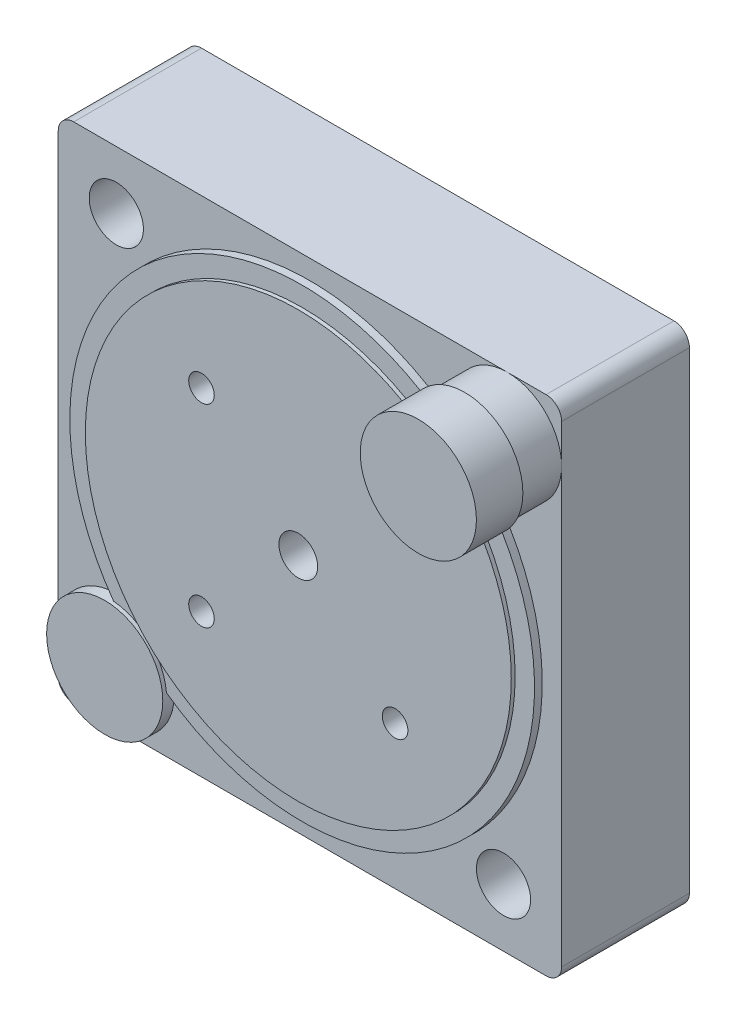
from build123d import *

# Parameters (mm, degrees)
SKETCH_1_W             = 65
SKETCH_1_H             = 65
EXTRUDE_1_DEPTH        = 16.5
SKETCH_2_R             = 30
EXTRUDE_2_DEPTH        = 1.5
SKETCH_4_OUTSIDE_W     = 85.734
SKETCH_4_OUTSIDE_H     = 85.734
SKETCH_4_OUTSIDE_R     = 27.5
CUT_EXTRUDE_1_DEPTH    = 0.5
SKETCH_3_R             = 7.5
EXTRUDE_3_DEPTH        = 1.5
SKETCH_5_R             = 7
EXTRUDE_4_DEPTH        = 11.5
SKETCH_6_R             = 7.5
EXTRUDE_5_DEPTH        = 6
HOLE_WIZARD_7_0_7_1_D  = 7
HOLE_WIZARD_M6_1_D     = 5
HOLE_WIZARD_M4_1_D     = 3.3
FILLET_1_R             = 2
HOLE_WIZARD_M6_2_D     = 5
HOLE_WIZARD_M6_2_DEPTH = 15
HOLE_WIZARD_M6_2_TIP   = 1.502151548
SKETCH_15_W            = 0.73828125
SKETCH_15_H            = 0.873597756
SKETCH_15_W_2          = 0.776141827
SKETCH_15_H_2          = 1.053084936
CUT_EXTRUDE_2_DEPTH    = 3


with BuildPart() as part:
    # Sketch 1 → Extrude 1 (new body)
    with BuildSketch(Plane.XY):
        Rectangle(SKETCH_1_W, SKETCH_1_H)
    extrude(amount=EXTRUDE_1_DEPTH)

    # Sketch 2 → Extrude 2 (add)
    with BuildSketch(Plane.XY.offset(16.5)):
        Circle(SKETCH_2_R)
    extrude(amount=EXTRUDE_2_DEPTH)

    # Sketch 4 outside → Cut-Extrude 1 (cut)
    with BuildSketch(Plane.XY.offset(18)):
        Rectangle(SKETCH_4_OUTSIDE_W, SKETCH_4_OUTSIDE_H)
        Circle(SKETCH_4_OUTSIDE_R, mode=Mode.SUBTRACT)
    extrude(amount=-CUT_EXTRUDE_1_DEPTH, mode=Mode.SUBTRACT)

    # Sketch 3 → Extrude 3 (add)
    with BuildSketch(Plane.XY.offset(16.5)):
        with Locations(Location((-25, -25, 0), (0, 0, 180))):
            Circle(SKETCH_3_R)
    extrude(amount=EXTRUDE_3_DEPTH)

    # Sketch 5 → Extrude 4 (add)
    with BuildSketch(Plane.XY.offset(16.5)):
        with Locations((25.5, 25.5)):
            Circle(SKETCH_5_R)
    extrude(amount=EXTRUDE_4_DEPTH)

    # Sketch 6 → Extrude 5 (add)
    with BuildSketch(Plane.XY.offset(28)):
        with Locations((25.5, 25.5)):
            Circle(SKETCH_6_R)
    extrude(amount=-EXTRUDE_5_DEPTH)

    # Hole Wizard 7.0 _7_ _1 (through all)
    with Locations(Plane.XY.offset(16.5)):
        with Locations((-25, 25), (25, -25)):
            Hole(HOLE_WIZARD_7_0_7_1_D / 2)

    # Hole Wizard M6 _1 (through all)
    with Locations(Plane.XY.offset(18)):
        with Locations((0, 0)):
            Hole(HOLE_WIZARD_M6_1_D / 2)

    # Hole Wizard M4 _1 (through all)
    with Locations(Plane.XY.offset(18)):
        with Locations((-12.5, 12.5), (12.5, 12.5), (-12.5, -12.5), (12.5, -12.5)):
            Hole(HOLE_WIZARD_M4_1_D / 2)

    # Fillet 1
    fillet_1_edges = [part.edges().sort_by_distance(p)[0] for p in [
        (32.5, -32.5, 8.25),
        (-32.5, -32.5, 8.25),
        (-32.5, 32.5, 8.25),
        (32.5, 32.5, 8.25),
    ]]
    fillet(fillet_1_edges, radius=FILLET_1_R)

    # Hole Wizard M6 _2
    with Locations(Plane.ZY.offset(32.5)):
        with Locations((9, 0)):
            Hole(HOLE_WIZARD_M6_2_D / 2, depth=HOLE_WIZARD_M6_2_DEPTH)
            with Locations((0, 0, -(HOLE_WIZARD_M6_2_DEPTH + HOLE_WIZARD_M6_2_TIP / 2))):  # 118° drill point
                Cone(0, HOLE_WIZARD_M6_2_D / 2, HOLE_WIZARD_M6_2_TIP, mode=Mode.SUBTRACT)

    # Sketch 15 → Cut-Extrude 2 (cut)
    # profile 1 of 11: a face of its own
    with BuildSketch(Plane.XZ.offset(32.5)):
        with BuildLine():
            Line((-5.189964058, 4.936644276), (-4.906009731, 4.747341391))
            add(Edge.make_bspline(
                [(-4.906009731, 4.747341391), (-4.845937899, 4.756158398), (-4.728766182, 4.773356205), (-4.557537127, 4.799576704), (-4.395631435, 4.827826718), (-4.242743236, 4.856430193), (-4.098766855, 4.885920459), (-3.963627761, 4.915919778), (-3.837570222, 4.946551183), (-3.72071617, 4.978247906), (-3.612866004, 5.010274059), (-3.513889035, 5.043079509), (-3.423882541, 5.076835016), (-3.34266128, 5.110628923), (-3.270718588, 5.14604351), (-3.207322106, 5.181097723), (-3.153628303, 5.218430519), (-3.122398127, 5.245132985), (-3.107632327, 5.257758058)],
                knots=[0, 0, 0, 0, 1.544068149, 3.01174623, 4.405109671, 5.723493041, 6.967204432, 8.142411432, 9.243727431, 10.265945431, 11.221193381, 12.104547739, 12.91703865, 13.665462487, 14.340610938, 14.955432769, 15.506122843, 16, 16, 16, 16], degree=3))
            Line((-3.107632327, 5.257758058), (-2.842608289, 4.87985341))
            add(Edge.make_bspline(
                [(-2.842608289, 4.87985341), (-2.867150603, 4.879765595), (-2.918354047, 4.879582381), (-2.998277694, 4.876320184), (-3.084084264, 4.872422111), (-3.175935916, 4.865892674), (-3.273373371, 4.857416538), (-3.376895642, 4.84746902), (-3.486325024, 4.836477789), (-3.561270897, 4.827619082), (-3.599819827, 4.823062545)],
                knots=[0, 0, 0, 0, 0.775214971, 1.617356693, 2.526504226, 3.488547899, 4.525910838, 5.616073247, 6.773810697, 8, 8, 8, 8], degree=3))
            add(Edge.make_bspline(
                [(-3.599819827, 4.823062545), (-3.64118565, 4.816750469), (-3.727641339, 4.803558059), (-3.862624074, 4.783002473), (-4.008927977, 4.762613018), (-4.166573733, 4.742772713), (-4.335480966, 4.720780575), (-4.515631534, 4.698241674), (-4.707094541, 4.676029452), (-4.838465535, 4.661078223), (-4.906009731, 4.653391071)],
                knots=[0, 0, 0, 0, 0.762389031, 1.593413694, 2.487650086, 3.453631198, 4.488270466, 5.591033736, 6.761433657, 8, 8, 8, 8], degree=3))
            add(Edge.make_bspline(
                [(-4.906009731, 4.653391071), (-4.906193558, 4.585148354), (-4.906556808, 4.450297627), (-4.907957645, 4.250943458), (-4.910127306, 4.056966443), (-4.912640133, 3.868819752), (-4.917099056, 3.686067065), (-4.921926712, 3.509147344), (-4.927473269, 3.337591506), (-4.934107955, 3.171363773), (-4.943937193, 3.009672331), (-4.960848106, 2.852474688), (-4.984011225, 2.699255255), (-5.013291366, 2.549666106), (-5.04969282, 2.403602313), (-5.093475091, 2.261577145), (-5.142140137, 2.122945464), (-5.198848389, 1.98825135), (-5.262733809, 1.855399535), (-5.336953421, 1.724098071), (-5.420116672, 1.5929975), (-5.514122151, 1.463091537), (-5.617073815, 1.333286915), (-5.730552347, 1.20435745), (-5.852711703, 1.07505357), (-5.940449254, 0.992180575), (-5.985036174, 0.95006575)],
                knots=[0, 0, 0, 0, 1.224615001, 2.419895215, 3.577469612, 4.705743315, 5.796437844, 6.857891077, 7.881743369, 8.876573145, 9.843210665, 10.788012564, 11.712690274, 12.623183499, 13.522353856, 14.41253017, 15.289328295, 16.157781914, 17.033737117, 17.933161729, 18.862743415, 19.81830003, 20.809276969, 21.834648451, 22.899600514, 24, 24, 24, 24], degree=3))
            Line((-5.985036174, 0.95006575), (-6.041827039, 1.006856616))
            add(Edge.make_bspline(
                [(-6.041827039, 1.006856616), (-6.007827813, 1.046537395), (-5.940335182, 1.125308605), (-5.845566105, 1.248039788), (-5.756089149, 1.373118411), (-5.674710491, 1.502553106), (-5.597605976, 1.633390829), (-5.528300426, 1.768039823), (-5.464476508, 1.905252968), (-5.406137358, 2.046747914), (-5.354575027, 2.195281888), (-5.309520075, 2.353447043), (-5.272434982, 2.522906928), (-5.23958059, 2.702830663), (-5.216049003, 2.894172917), (-5.196700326, 3.095893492), (-5.18513532, 3.308745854), (-5.180363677, 3.528299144), (-5.178514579, 3.746836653), (-5.178210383, 3.956009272), (-5.177064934, 4.152087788), (-5.17764307, 4.334622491), (-5.180248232, 4.504050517), (-5.181768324, 4.659952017), (-5.185453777, 4.802746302), (-5.188507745, 4.893410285), (-5.189964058, 4.936644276)],
                knots=[0, 0, 0, 0, 0.908799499, 1.804078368, 2.696297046, 3.582708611, 4.462617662, 5.337176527, 6.215647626, 7.094372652, 7.998175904, 8.949130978, 9.953139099, 11.014501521, 12.129355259, 13.305269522, 14.538965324, 15.836175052, 17.124904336, 18.340408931, 19.474609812, 20.535637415, 21.515428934, 22.422052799, 23.247540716, 24, 24, 24, 24], degree=3))
        make_face()
    # profile 2 of 11: a face of its own
    with BuildSketch(Plane.XZ.offset(32.5)):
        with BuildLine():
            add(Edge.make_bspline(
                [(-4.640985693, 1.346900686), (-4.633415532, 1.35554184), (-4.617688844, 1.373493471), (-4.599518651, 1.406716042), (-4.585330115, 1.445595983), (-4.572767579, 1.489982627), (-4.566877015, 1.540754), (-4.56237651, 1.596870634), (-4.561853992, 1.658942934), (-4.56409112, 1.702144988), (-4.565264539, 1.724805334)],
                knots=[0, 0, 0, 0, 0.695601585, 1.445082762, 2.280142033, 3.205704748, 4.236765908, 5.374684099, 6.622969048, 8, 8, 8, 8], degree=3))
            Line((-4.565264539, 1.724805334), (-4.565264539, 3.556135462))
            add(Edge.make_bspline(
                [(-4.565264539, 3.556135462), (-4.565556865, 3.616668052), (-4.566120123, 3.733303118), (-4.569732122, 3.90088261), (-4.574768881, 4.054495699), (-4.581148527, 4.151867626), (-4.584194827, 4.198363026)],
                knots=[0, 0, 0, 0, 1.130337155, 2.177949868, 3.129965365, 4, 4, 4, 4], degree=3))
            Line((-4.584194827, 4.198363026), (-4.319170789, 4.028691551))
            add(Edge.make_bspline(
                [(-4.319170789, 4.028691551), (-4.248933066, 4.041399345), (-4.113303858, 4.065938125), (-3.918666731, 4.111473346), (-3.739009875, 4.159497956), (-3.574971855, 4.214473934), (-3.425585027, 4.273982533), (-3.291875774, 4.341467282), (-3.172539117, 4.414976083), (-3.10329801, 4.472630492), (-3.069771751, 4.500546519)],
                knots=[0, 0, 0, 0, 1.267382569, 2.447318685, 3.548814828, 4.568596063, 5.518112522, 6.401622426, 7.226072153, 8, 8, 8, 8], degree=3))
            Line((-3.069771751, 4.500546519), (-2.804747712, 4.179432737))
            add(Edge.make_bspline(
                [(-2.804747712, 4.179432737), (-2.847070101, 4.175676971), (-2.933947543, 4.167967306), (-3.067753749, 4.151812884), (-3.208379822, 4.129755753), (-3.304445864, 4.11254196), (-3.353726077, 4.103711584)],
                knots=[0, 0, 0, 0, 0.919581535, 1.887674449, 2.916413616, 4, 4, 4, 4], degree=3))
            add(Edge.make_bspline(
                [(-3.353726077, 4.103711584), (-3.402538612, 4.091888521), (-3.49697923, 4.069013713), (-3.634130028, 4.038158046), (-3.761924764, 4.011797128), (-3.844238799, 3.99763367), (-3.883774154, 3.990830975)],
                knots=[0, 0, 0, 0, 1.111816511, 2.151099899, 3.111974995, 4, 4, 4, 4], degree=3))
            add(Edge.make_bspline(
                [(-3.883774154, 3.990830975), (-3.876255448, 3.932143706), (-3.861865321, 3.81982155), (-3.838245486, 3.659627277), (-3.817135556, 3.515020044), (-3.795291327, 3.386746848), (-3.774279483, 3.274313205), (-3.754460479, 3.177591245), (-3.734325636, 3.096946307), (-3.719865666, 3.048946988), (-3.713401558, 3.027489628)],
                knots=[0, 0, 0, 0, 1.450010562, 2.775189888, 3.968369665, 5.031461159, 5.963854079, 6.771533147, 7.450832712, 8, 8, 8, 8], degree=3))
            add(Edge.make_bspline(
                [(-3.713401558, 3.027489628), (-3.668993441, 3.055643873), (-3.581922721, 3.110845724), (-3.45816386, 3.197915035), (-3.342349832, 3.285485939), (-3.236429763, 3.375243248), (-3.137928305, 3.46483534), (-3.049946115, 3.556863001), (-2.969807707, 3.649396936), (-2.922594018, 3.713799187), (-2.899399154, 3.745438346)],
                knots=[0, 0, 0, 0, 1.154897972, 2.264401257, 3.323042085, 4.343228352, 5.313317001, 6.24645786, 7.138530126, 8, 8, 8, 8], degree=3))
            Line((-2.899399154, 3.745438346), (-2.615444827, 3.405394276))
            add(Edge.make_bspline(
                [(-2.615444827, 3.405394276), (-2.630430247, 3.40475802), (-2.661743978, 3.403428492), (-2.710780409, 3.395123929), (-2.763797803, 3.381891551), (-2.820853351, 3.362217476), (-2.882437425, 3.33882871), (-2.94757594, 3.308750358), (-3.017266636, 3.274616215), (-3.064276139, 3.248560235), (-3.088702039, 3.23502168)],
                knots=[0, 0, 0, 0, 0.708525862, 1.480544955, 2.34612496, 3.289518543, 4.331893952, 5.459395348, 6.679914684, 8, 8, 8, 8], degree=3))
            add(Edge.make_bspline(
                [(-3.088702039, 3.23502168), (-3.141454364, 3.20731816), (-3.245008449, 3.152935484), (-3.398723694, 3.074943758), (-3.548030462, 3.002172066), (-3.646285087, 2.955652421), (-3.69447127, 2.932838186)],
                knots=[0, 0, 0, 0, 1.056100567, 2.073150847, 3.055031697, 4, 4, 4, 4], degree=3))
            add(Edge.make_bspline(
                [(-3.69447127, 2.932838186), (-3.67267685, 2.872154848), (-3.630432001, 2.754530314), (-3.562458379, 2.586343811), (-3.493296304, 2.431830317), (-3.422598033, 2.291467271), (-3.350970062, 2.164903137), (-3.279285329, 2.051289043), (-3.205034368, 1.952230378), (-3.128903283, 1.866335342), (-3.051705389, 1.790579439), (-2.972724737, 1.722654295), (-2.892897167, 1.659809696), (-2.810715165, 1.603536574), (-2.726345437, 1.553973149), (-2.641042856, 1.509392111), (-2.553482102, 1.471991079), (-2.493820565, 1.45169556), (-2.46400252, 1.441552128)],
                knots=[0, 0, 0, 0, 1.538195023, 2.981534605, 4.326673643, 5.575948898, 6.72951937, 7.795199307, 8.778759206, 9.679373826, 10.531020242, 11.35715119, 12.163553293, 12.953833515, 13.73126344, 14.496846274, 15.248743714, 16, 16, 16, 16], degree=3))
            Line((-2.46400252, 1.441552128), (-2.46400252, 1.365830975))
            add(Edge.make_bspline(
                [(-2.46400252, 1.365830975), (-2.492594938, 1.362595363), (-2.547073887, 1.356430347), (-2.623764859, 1.339762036), (-2.692055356, 1.320785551), (-2.751471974, 1.297101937), (-2.802128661, 1.268996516), (-2.843759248, 1.236697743), (-2.877896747, 1.200610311), (-2.892300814, 1.172266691), (-2.899399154, 1.158298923)],
                knots=[0, 0, 0, 0, 1.371464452, 2.613138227, 3.738449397, 4.748506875, 5.656825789, 6.490697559, 7.256214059, 8, 8, 8, 8], degree=3))
            add(Edge.make_bspline(
                [(-2.899399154, 1.158298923), (-2.935271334, 1.192064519), (-3.007145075, 1.259717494), (-3.109168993, 1.36816641), (-3.205523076, 1.483449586), (-3.29847165, 1.604001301), (-3.386086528, 1.73115918), (-3.468772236, 1.864378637), (-3.546574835, 2.003953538), (-3.608697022, 2.12464736), (-3.653735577, 2.227132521), (-3.688281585, 2.308364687), (-3.718172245, 2.395747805), (-3.748875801, 2.487291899), (-3.776544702, 2.584286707), (-3.80318451, 2.685972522), (-3.828590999, 2.792492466), (-3.851390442, 2.904122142), (-3.873389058, 3.020444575), (-3.8927066, 3.141857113), (-3.910995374, 3.268065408), (-3.92770442, 3.399205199), (-3.943345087, 3.535192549), (-3.956395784, 3.676418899), (-3.968372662, 3.822491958), (-3.975044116, 3.92164444), (-3.978425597, 3.971900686)],
                knots=[0, 0, 0, 0, 1.144011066, 2.292148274, 3.455568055, 4.632433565, 5.826423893, 7.040455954, 8.272567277, 9.537294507, 10.190936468, 10.872363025, 11.586554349, 12.334951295, 13.114849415, 13.928490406, 14.776373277, 15.657819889, 16.574447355, 17.52571356, 18.512896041, 19.536260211, 20.596044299, 21.691938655, 22.830140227, 24, 24, 24, 24], degree=3))
            Line((-3.978425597, 3.971900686), (-4.319170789, 3.934040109))
            Line((-4.319170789, 3.934040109), (-4.319170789, 1.497641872))
            Line((-4.319170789, 1.497641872), (-3.656610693, 1.799825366))
            Line((-3.656610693, 1.799825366), (-3.618750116, 1.743735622))
            add(Edge.make_bspline(
                [(-3.618750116, 1.743735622), (-3.670157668, 1.710180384), (-3.768482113, 1.646001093), (-3.906037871, 1.548660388), (-4.029202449, 1.457638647), (-4.1358716, 1.369571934), (-4.228211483, 1.287363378), (-4.304847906, 1.209482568), (-4.367573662, 1.137055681), (-4.399154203, 1.086929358), (-4.413822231, 1.063647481)],
                knots=[0, 0, 0, 0, 1.398177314, 2.674218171, 3.837894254, 4.885504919, 5.824054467, 6.652201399, 7.373995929, 8, 8, 8, 8], degree=3))
            Line((-4.413822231, 1.063647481), (-4.640985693, 1.346900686))
        make_face()
    # profile 3 of 11: a face of its own
    with BuildSketch(Plane.XZ.offset(32.5)):
        with BuildLine():
            add(Edge.make_bspline(
                [(-5.436057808, 4.443755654), (-5.459967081, 4.36735545), (-5.506440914, 4.218851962), (-5.572980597, 4.002111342), (-5.634988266, 3.798126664), (-5.694454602, 3.607506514), (-5.748087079, 3.429474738), (-5.797955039, 3.264505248), (-5.843898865, 3.112538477), (-5.883887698, 2.972913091), (-5.921821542, 2.846837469), (-5.953361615, 2.733150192), (-5.982765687, 2.632973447), (-6.006423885, 2.545211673), (-6.026058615, 2.470423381), (-6.041656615, 2.408527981), (-6.053024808, 2.359701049), (-6.066663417, 2.290306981), (-6.0789951, 2.190971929), (-6.09481328, 2.053587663), (-6.107934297, 1.903026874), (-6.116453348, 1.770902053), (-6.121432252, 1.663557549), (-6.126237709, 1.587420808), (-6.128498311, 1.517261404), (-6.13162126, 1.453016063), (-6.133771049, 1.394586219), (-6.134820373, 1.341987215), (-6.136815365, 1.295497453), (-6.136585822, 1.266507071), (-6.136478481, 1.252950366)],
                knots=[0, 0, 0, 0, 2.047258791, 3.979375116, 5.798124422, 7.499547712, 9.08585655, 10.553088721, 11.906970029, 13.145823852, 14.267298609, 15.273803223, 16.162908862, 16.937141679, 17.598183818, 18.140321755, 18.569481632, 18.880098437, 19.948477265, 21.12727002, 22.417271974, 23.812729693, 24.512924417, 25.165372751, 25.763522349, 26.307928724, 26.810292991, 27.258706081, 27.653350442, 28, 28, 28, 28], degree=3))
            add(Edge.make_bspline(
                [(-6.136478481, 1.252950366), (-6.137232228, 1.241789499), (-6.138611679, 1.221363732), (-6.153502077, 1.194252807), (-6.180613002, 1.179362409), (-6.201038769, 1.177982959), (-6.212199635, 1.177229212)],
                knots=[0, 0, 0, 0, 1.092822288, 2, 2.907177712, 4, 4, 4, 4], degree=3))
            add(Edge.make_bspline(
                [(-6.212199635, 1.177229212), (-6.220430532, 1.178153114), (-6.240591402, 1.180416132), (-6.275592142, 1.192542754), (-6.320937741, 1.21086005), (-6.374762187, 1.233095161), (-6.428879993, 1.264498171), (-6.46825284, 1.313792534), (-6.49264549, 1.37401151), (-6.494938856, 1.41816046), (-6.496153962, 1.441552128)],
                knots=[0, 0, 0, 0, 0.46413085, 1.136848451, 2.068075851, 3.214394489, 4.412535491, 5.532005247, 6.692369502, 8, 8, 8, 8], degree=3))
            add(Edge.make_bspline(
                [(-6.496153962, 1.441552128), (-6.494357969, 1.485933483), (-6.490740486, 1.575326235), (-6.469159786, 1.662154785), (-6.458293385, 1.705875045)],
                knots=[0, 0, 0, 0, 0.992951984, 2, 2, 2, 2], degree=3))
            add(Edge.make_bspline(
                [(-6.458293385, 1.705875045), (-6.44987693, 1.735727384), (-6.434044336, 1.79188404), (-6.415276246, 1.871941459), (-6.404001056, 1.942999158), (-6.402293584, 1.987460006), (-6.40150252, 2.008058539)],
                knots=[0, 0, 0, 0, 1.206693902, 2.269969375, 3.19848375, 4, 4, 4, 4], degree=3))
            add(Edge.make_bspline(
                [(-6.40150252, 2.008058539), (-6.402621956, 2.02639074), (-6.404788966, 2.061878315), (-6.420624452, 2.113158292), (-6.449013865, 2.158212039), (-6.480322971, 2.19241449), (-6.512563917, 2.216873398), (-6.543186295, 2.236085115), (-6.580289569, 2.254453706), (-6.623282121, 2.27352856), (-6.672479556, 2.29230709), (-6.727930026, 2.311152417), (-6.789663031, 2.330074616), (-6.833124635, 2.341916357), (-6.855829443, 2.348102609)],
                knots=[0, 0, 0, 0, 1.072895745, 2.07691749, 3.102434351, 4.167448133, 4.772305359, 5.467060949, 6.280958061, 7.193747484, 8.220359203, 9.36272971, 10.622261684, 12, 12, 12, 12], degree=3))
            Line((-6.855829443, 2.348102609), (-6.855829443, 2.423122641))
            add(Edge.make_bspline(
                [(-6.855829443, 2.423122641), (-6.828723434, 2.42027879), (-6.777332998, 2.414887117), (-6.704184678, 2.407822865), (-6.638980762, 2.402167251), (-6.581717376, 2.397930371), (-6.532405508, 2.395050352), (-6.491251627, 2.393475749), (-6.458061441, 2.393534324), (-6.423131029, 2.394362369), (-6.381275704, 2.408121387), (-6.335403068, 2.444656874), (-6.286502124, 2.4970102), (-6.250642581, 2.5484822), (-6.222908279, 2.594114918), (-6.204655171, 2.633228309), (-6.181591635, 2.684197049), (-6.154233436, 2.747543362), (-6.122789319, 2.822983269), (-6.087734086, 2.910959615), (-6.048877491, 3.011236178), (-6.003982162, 3.123099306), (-5.95771998, 3.248443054), (-5.905656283, 3.385470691), (-5.849351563, 3.534878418), (-5.790136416, 3.696831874), (-5.726080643, 3.870850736), (-5.658333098, 4.057210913), (-5.585769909, 4.255652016), (-5.536930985, 4.392308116), (-5.511778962, 4.462685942)],
                knots=[0, 0, 0, 0, 0.841070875, 1.594591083, 2.267795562, 2.860770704, 3.366442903, 3.792202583, 4.131172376, 4.391209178, 4.867919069, 5.456491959, 6.18094247, 7.075507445, 7.385964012, 7.827850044, 8.405630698, 9.113044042, 9.956862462, 10.927824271, 12.03541951, 13.275590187, 14.647278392, 16.158248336, 17.799208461, 19.5744166, 21.479632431, 23.521631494, 25.693642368, 28, 28, 28, 28], degree=3))
            Line((-5.511778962, 4.462685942), (-5.436057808, 4.443755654))
        make_face()
    # profile 4 of 11: a face of its own
    with BuildSketch(Plane.XZ.offset(32.5)):
        with BuildLine():
            add(Edge.make_bspline(
                [(-6.855829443, 4.159801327), (-6.80540413, 4.137051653), (-6.710484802, 4.094228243), (-6.579647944, 4.028206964), (-6.469821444, 3.96344647), (-6.379157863, 3.902800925), (-6.309168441, 3.842926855), (-6.258377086, 3.785861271), (-6.227001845, 3.729057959), (-6.218831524, 3.65860526), (-6.228521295, 3.584664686), (-6.240228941, 3.508993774), (-6.258159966, 3.450999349), (-6.284665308, 3.410962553), (-6.313383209, 3.386847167), (-6.337792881, 3.368600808), (-6.360556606, 3.356775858), (-6.375694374, 3.355013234), (-6.382572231, 3.354212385)],
                knots=[0, 0, 0, 0, 2.181570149, 4.106532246, 5.775743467, 7.207387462, 8.403035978, 9.39672885, 10.212860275, 10.911506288, 12.150695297, 13.143233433, 13.933130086, 14.523645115, 15.006620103, 15.403044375, 15.72877275, 16, 16, 16, 16], degree=3))
            add(Edge.make_bspline(
                [(-6.382572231, 3.354212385), (-6.387618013, 3.354763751), (-6.398493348, 3.355952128), (-6.413498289, 3.366900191), (-6.429617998, 3.38129976), (-6.445524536, 3.402378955), (-6.462467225, 3.428544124), (-6.479776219, 3.46068658), (-6.497172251, 3.499102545), (-6.508839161, 3.526660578), (-6.515084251, 3.541411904)],
                knots=[0, 0, 0, 0, 0.504873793, 1.088170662, 1.823717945, 2.697866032, 3.739426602, 4.975884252, 6.381244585, 8, 8, 8, 8], degree=3))
            add(Edge.make_bspline(
                [(-6.515084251, 3.541411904), (-6.523716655, 3.562321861), (-6.541524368, 3.605456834), (-6.574040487, 3.670133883), (-6.613125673, 3.736632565), (-6.656781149, 3.806175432), (-6.708294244, 3.876882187), (-6.76360729, 3.951328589), (-6.826646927, 4.02689728), (-6.870921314, 4.077624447), (-6.89369002, 4.103711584)],
                knots=[0, 0, 0, 0, 0.79673179, 1.643571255, 2.547328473, 3.513435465, 4.534626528, 5.62797424, 6.780153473, 8, 8, 8, 8], degree=3))
            Line((-6.89369002, 4.103711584), (-6.855829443, 4.159801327))
        make_face()
    # profile 5 of 11: a face of its own
    with BuildSketch(Plane.XZ.offset(32.5)):
        with BuildLine():
            add(Edge.make_bspline(
                [(-6.344711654, 5.238827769), (-6.304397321, 5.219428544), (-6.228004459, 5.18266836), (-6.12162245, 5.127079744), (-6.02874366, 5.076531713), (-5.950847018, 5.028672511), (-5.886378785, 4.985633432), (-5.836267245, 4.945769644), (-5.799095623, 4.910188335), (-5.771918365, 4.867730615), (-5.753901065, 4.821576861), (-5.735156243, 4.776918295), (-5.72331116, 4.74229085), (-5.720957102, 4.72238092), (-5.720012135, 4.714388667)],
                knots=[0, 0, 0, 0, 1.891034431, 3.583378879, 5.073566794, 6.359571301, 7.447405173, 8.34690062, 9.066456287, 9.609003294, 10.462625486, 11.15423993, 11.660494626, 12, 12, 12, 12], degree=3))
            add(Edge.make_bspline(
                [(-5.720012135, 4.714388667), (-5.720824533, 4.698639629), (-5.722474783, 4.666648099), (-5.73620957, 4.61928568), (-5.75640039, 4.571433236), (-5.785402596, 4.527451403), (-5.814543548, 4.487749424), (-5.842276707, 4.458752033), (-5.866067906, 4.437815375), (-5.883145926, 4.434601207), (-5.890384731, 4.433238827)],
                knots=[0, 0, 0, 0, 1.09206366, 2.218344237, 3.403573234, 4.687330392, 5.869219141, 6.810819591, 7.495945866, 8, 8, 8, 8], degree=3))
            add(Edge.make_bspline(
                [(-5.890384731, 4.433238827), (-5.900223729, 4.435954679), (-5.924083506, 4.442540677), (-5.951759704, 4.479895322), (-5.979080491, 4.533036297), (-5.994930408, 4.576646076), (-6.003966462, 4.601508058)],
                knots=[0, 0, 0, 0, 0.567109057, 1.375251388, 2.503627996, 4, 4, 4, 4], degree=3))
            add(Edge.make_bspline(
                [(-6.003966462, 4.601508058), (-6.012612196, 4.623807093), (-6.030482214, 4.669897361), (-6.062809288, 4.739321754), (-6.101911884, 4.810755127), (-6.145591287, 4.885154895), (-6.196855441, 4.960772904), (-6.252636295, 5.039515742), (-6.31539549, 5.120003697), (-6.359778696, 5.173958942), (-6.382572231, 5.201668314)],
                knots=[0, 0, 0, 0, 0.8048195, 1.66349557, 2.575018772, 3.544945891, 4.56593255, 5.648566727, 6.792392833, 8, 8, 8, 8], degree=3))
            Line((-6.382572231, 5.201668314), (-6.344711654, 5.238827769))
        make_face()
    # profile 6 of 11: a face of its own
    with BuildSketch(Plane.XZ.offset(32.5)):
        with BuildLine():
            add(Edge.make_bspline(
                [(1.833172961, 4.088286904), (1.833192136, 4.017941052), (1.833229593, 3.880521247), (1.832963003, 3.679298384), (1.833903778, 3.487659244), (1.834548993, 3.305601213), (1.835241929, 3.132891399), (1.836020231, 2.969530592), (1.836438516, 2.815747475), (1.838079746, 2.671553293), (1.839429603, 2.536937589), (1.840809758, 2.411669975), (1.842297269, 2.29575264), (1.84340384, 2.189406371), (1.845720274, 2.092658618), (1.847779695, 2.005484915), (1.849841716, 1.927892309), (1.851383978, 1.879285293), (1.852103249, 1.856616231)],
                knots=[0, 0, 0, 0, 1.512932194, 2.955495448, 4.327698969, 5.634560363, 6.871053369, 8.042204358, 9.148013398, 10.178464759, 11.143576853, 12.043350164, 12.872759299, 13.636831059, 14.330631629, 14.954081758, 15.512210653, 16, 16, 16, 16], degree=3))
            Line((1.852103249, 1.856616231), (1.587079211, 1.724104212))
            Line((1.587079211, 1.724104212), (1.587079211, 2.026988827))
            Line((1.587079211, 2.026988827), (-0.173437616, 2.026988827))
            Line((-0.173437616, 2.026988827), (-0.173437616, 1.818755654))
            Line((-0.173437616, 1.818755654), (-0.438461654, 1.705173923))
            add(Edge.make_bspline(
                [(-0.438461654, 1.705173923), (-0.435428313, 1.808233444), (-0.429197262, 2.019937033), (-0.424075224, 2.345285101), (-0.420543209, 2.686735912), (-0.419006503, 3.040343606), (-0.420583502, 3.398624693), (-0.424118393, 3.753863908), (-0.429335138, 4.102109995), (-0.435439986, 4.332048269), (-0.438461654, 4.445859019)],
                knots=[0, 0, 0, 0, 0.902750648, 1.854419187, 2.848971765, 3.892590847, 4.950533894, 5.986010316, 7.003151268, 8, 8, 8, 8], degree=3))
            Line((-0.438461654, 4.445859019), (-0.173437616, 4.294416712))
            Line((-0.173437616, 4.294416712), (0.564843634, 4.294416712))
            add(Edge.make_bspline(
                [(0.564843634, 4.294416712), (0.564980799, 4.345832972), (0.565248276, 4.446096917), (0.563355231, 4.592393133), (0.562238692, 4.730753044), (0.56020496, 4.860933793), (0.557074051, 4.98291596), (0.55485077, 5.096765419), (0.55022962, 5.202374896), (0.547311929, 5.270144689), (0.545913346, 5.302629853)],
                knots=[0, 0, 0, 0, 1.22359209, 2.386057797, 3.481785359, 4.516411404, 5.484417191, 6.385700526, 7.226192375, 8, 8, 8, 8], degree=3))
            Line((0.545913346, 5.302629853), (0.943449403, 5.097201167))
            Line((0.943449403, 5.097201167), (0.810937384, 4.98502168))
            Line((0.810937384, 4.98502168), (0.810937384, 4.294416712))
            Line((0.810937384, 4.294416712), (1.549218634, 4.294416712))
            Line((1.549218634, 4.294416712), (1.738521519, 4.483719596))
            Line((1.738521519, 4.483719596), (2.003545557, 4.21939668))
            Line((2.003545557, 4.21939668), (1.833172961, 4.088286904))
        make_face()
        with Locations((0.195703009, 3.744036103)):
            Rectangle(SKETCH_15_W, SKETCH_15_H, mode=Mode.SUBTRACT)
        with Locations((1.199008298, 3.744036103)):
            Rectangle(SKETCH_15_W_2, SKETCH_15_H, mode=Mode.SUBTRACT)
        with Locations((0.195703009, 2.667113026)):
            Rectangle(SKETCH_15_W, SKETCH_15_H_2, mode=Mode.SUBTRACT)
        with Locations((1.199008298, 2.667113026)):
            Rectangle(SKETCH_15_W_2, SKETCH_15_H_2, mode=Mode.SUBTRACT)
    # profile 7 of 11: a face of its own
    with BuildSketch(Plane.XZ.offset(32.5)):
        with BuildLine():
            add(Edge.make_bspline(
                [(-1.082091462, 2.019276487), (-1.054251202, 1.986844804), (-0.995342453, 1.918220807), (-0.887334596, 1.822945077), (-0.760936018, 1.725427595), (-0.642037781, 1.642539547), (-0.529755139, 1.579977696), (-0.426410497, 1.539783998), (-0.308167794, 1.503152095), (-0.173708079, 1.473079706), (-0.023517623, 1.447125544), (0.142691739, 1.427479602), (0.324597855, 1.411999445), (0.521042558, 1.402506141), (0.728886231, 1.398936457), (0.945120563, 1.398441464), (1.168126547, 1.404469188), (1.397897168, 1.415018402), (1.634494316, 1.430232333), (1.877719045, 1.451946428), (2.127948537, 1.476441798), (2.296657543, 1.497491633), (2.382151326, 1.508158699)],
                knots=[0, 0, 0, 0, 0.702632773, 1.486739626, 2.363714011, 3.330109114, 3.868766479, 4.474365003, 5.150698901, 5.904482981, 6.739691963, 7.657941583, 8.657587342, 9.743434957, 10.893556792, 12.078059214, 13.301406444, 14.564142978, 15.862931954, 17.20239812, 18.582307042, 20, 20, 20, 20], degree=3))
            Line((2.382151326, 1.508158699), (2.382151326, 1.432437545))
            add(Edge.make_bspline(
                [(2.382151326, 1.432437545), (2.355350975, 1.425968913), (2.304309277, 1.413649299), (2.233759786, 1.387584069), (2.172779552, 1.357195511), (2.122277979, 1.321061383), (2.081191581, 1.280712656), (2.050299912, 1.235126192), (2.029954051, 1.184078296), (2.024999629, 1.147954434), (2.022475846, 1.12955293)],
                knots=[0, 0, 0, 0, 1.306508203, 2.488265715, 3.558933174, 4.527814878, 5.421237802, 6.275798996, 7.121691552, 8, 8, 8, 8], degree=3))
            add(Edge.make_bspline(
                [(2.022475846, 1.12955293), (1.950262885, 1.12796848), (1.809351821, 1.124876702), (1.603206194, 1.123398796), (1.40806151, 1.121275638), (1.223897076, 1.122602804), (1.050703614, 1.123376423), (0.888271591, 1.127114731), (0.736820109, 1.131945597), (0.595620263, 1.13803184), (0.462863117, 1.146612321), (0.336806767, 1.156747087), (0.216688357, 1.170292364), (0.102592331, 1.185591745), (-0.005746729, 1.202890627), (-0.108099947, 1.223359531), (-0.204703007, 1.245669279), (-0.295974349, 1.269970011), (-0.382706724, 1.298684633), (-0.465146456, 1.334014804), (-0.544922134, 1.374032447), (-0.621346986, 1.41965311), (-0.694776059, 1.47084288), (-0.763819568, 1.528922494), (-0.83106555, 1.590945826), (-0.872102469, 1.636591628), (-0.892788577, 1.659601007)],
                knots=[0, 0, 0, 0, 1.703725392, 3.324524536, 4.862589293, 6.306910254, 7.668575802, 8.947804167, 10.139158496, 11.242801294, 12.281285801, 13.276999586, 14.22546126, 15.132168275, 15.992227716, 16.812796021, 17.59372458, 18.330564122, 19.040068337, 19.746546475, 20.44423793, 21.143843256, 21.844295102, 22.552942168, 23.270559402, 24, 24, 24, 24], degree=3))
            add(Edge.make_bspline(
                [(-0.892788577, 1.659601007), (-0.913745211, 1.68047813), (-0.953205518, 1.719788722), (-1.010117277, 1.774171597), (-1.061291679, 1.819939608), (-1.105140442, 1.859262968), (-1.143850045, 1.889225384), (-1.1757386, 1.912266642), (-1.201759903, 1.926666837), (-1.223414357, 1.935054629), (-1.244081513, 1.933586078), (-1.265725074, 1.926729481), (-1.290139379, 1.913465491), (-1.318144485, 1.895030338), (-1.349787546, 1.871197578), (-1.384063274, 1.840564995), (-1.42167556, 1.804274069), (-1.477444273, 1.746339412), (-1.55088102, 1.663275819), (-1.63965568, 1.550113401), (-1.730877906, 1.42163766), (-1.789709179, 1.329183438), (-1.820372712, 1.280995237)],
                knots=[0, 0, 0, 0, 1.331225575, 2.506632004, 3.541670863, 4.42123934, 5.155498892, 5.744846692, 6.187201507, 6.496526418, 6.770180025, 7.099593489, 7.513528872, 8.01528533, 8.608468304, 9.294116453, 10.082567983, 10.960248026, 12.912345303, 15.06904582, 17.429930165, 20, 20, 20, 20], degree=3))
            Line((-1.820372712, 1.280995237), (-2.085396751, 1.546019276))
            add(Edge.make_bspline(
                [(-2.085396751, 1.546019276), (-2.024420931, 1.581895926), (-1.899791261, 1.655224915), (-1.713132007, 1.774116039), (-1.521216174, 1.901654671), (-1.393398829, 1.992073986), (-1.328185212, 2.038206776)],
                knots=[0, 0, 0, 0, 0.939630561, 1.920529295, 2.939034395, 4, 4, 4, 4], degree=3))
            Line((-1.328185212, 2.038206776), (-1.328185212, 3.552629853))
            Line((-1.328185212, 3.552629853), (-1.47962752, 3.552629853))
            add(Edge.make_bspline(
                [(-1.47962752, 3.552629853), (-1.519848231, 3.551973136), (-1.598795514, 3.5506841), (-1.715007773, 3.540042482), (-1.826513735, 3.522056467), (-1.898529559, 3.504483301), (-1.933954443, 3.495838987)],
                knots=[0, 0, 0, 0, 1.051078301, 2.063110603, 3.047236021, 4, 4, 4, 4], degree=3))
            Line((-1.933954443, 3.495838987), (-2.104327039, 3.666211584))
            Line((-2.104327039, 3.666211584), (-1.384976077, 3.666211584))
            Line((-1.384976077, 3.666211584), (-1.176742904, 3.874444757))
            Line((-1.176742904, 3.874444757), (-0.892788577, 3.59049043))
            Line((-0.892788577, 3.59049043), (-1.082091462, 3.476908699))
            Line((-1.082091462, 3.476908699), (-1.082091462, 2.019276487))
        make_face()
    # profile 8 of 11: a face of its own
    with BuildSketch(Plane.XZ.offset(32.5)):
        with BuildLine():
            Line((-1.650000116, 5.076167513), (-1.612139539, 5.132257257))
            add(Edge.make_bspline(
                [(-1.612139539, 5.132257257), (-1.586123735, 5.118605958), (-1.53564401, 5.092117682), (-1.46328145, 5.051242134), (-1.396223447, 5.011450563), (-1.334172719, 4.97279806), (-1.277434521, 4.935141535), (-1.226078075, 4.898107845), (-1.180601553, 4.861387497), (-1.127529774, 4.816375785), (-1.073077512, 4.759949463), (-1.024354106, 4.689350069), (-0.99351937, 4.618098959), (-0.985255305, 4.547385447), (-0.990304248, 4.483608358), (-1.003695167, 4.428048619), (-1.027291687, 4.382006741), (-1.061404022, 4.34985644), (-1.094448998, 4.32664988), (-1.122068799, 4.310355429), (-1.141479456, 4.297934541), (-1.153296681, 4.295389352), (-1.157812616, 4.294416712)],
                knots=[0, 0, 0, 0, 1.444561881, 2.802953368, 4.085952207, 5.27847808, 6.397183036, 7.433849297, 8.390416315, 9.270405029, 10.855453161, 12.229166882, 13.471162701, 14.629991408, 15.69027353, 16.604487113, 17.427159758, 18.19098319, 18.882963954, 19.409198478, 19.77422608, 20, 20, 20, 20], degree=3))
            add(Edge.make_bspline(
                [(-1.157812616, 4.294416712), (-1.165656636, 4.295086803), (-1.181594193, 4.296448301), (-1.204139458, 4.30832173), (-1.22545472, 4.325992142), (-1.244083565, 4.351919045), (-1.263154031, 4.382968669), (-1.27965463, 4.421924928), (-1.295848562, 4.467266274), (-1.304608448, 4.500465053), (-1.309254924, 4.518074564)],
                knots=[0, 0, 0, 0, 0.652085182, 1.324913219, 2.087864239, 2.951486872, 3.976769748, 5.131282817, 6.478356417, 8, 8, 8, 8], degree=3))
            add(Edge.make_bspline(
                [(-1.309254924, 4.518074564), (-1.326974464, 4.567441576), (-1.362871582, 4.667451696), (-1.440210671, 4.809909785), (-1.535283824, 4.948092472), (-1.611149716, 5.032792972), (-1.650000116, 5.076167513)],
                knots=[0, 0, 0, 0, 0.953628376, 1.931907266, 2.940943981, 4, 4, 4, 4], degree=3))
        make_face()
    # profile 9 of 11: a face of its own
    with BuildSketch(Plane.XZ.offset(32.5)):
        with BuildLine():
            Line((3.631550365, 3.890570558), (4.767367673, 3.890570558))
            Line((4.767367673, 3.890570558), (4.994531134, 4.117734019))
            Line((4.994531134, 4.117734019), (5.297415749, 3.776988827))
            Line((5.297415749, 3.776988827), (4.275180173, 3.776988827))
            Line((4.275180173, 3.776988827), (4.596995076, 3.605213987))
            add(Edge.make_bspline(
                [(4.596995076, 3.605213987), (4.587140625, 3.598772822), (4.565213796, 3.584440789), (4.5352043, 3.552001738), (4.50391551, 3.509113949), (4.472231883, 3.454290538), (4.437316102, 3.389373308), (4.404212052, 3.31172169), (4.366877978, 3.224136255), (4.344036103, 3.161064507), (4.331971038, 3.127750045)],
                knots=[0, 0, 0, 0, 0.508725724, 1.131949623, 1.899830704, 2.808433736, 3.873293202, 5.093153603, 6.464605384, 8, 8, 8, 8], degree=3))
            Line((4.331971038, 3.127750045), (4.805228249, 3.127750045))
            Line((4.805228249, 3.127750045), (4.937740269, 3.31705293))
            Line((4.937740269, 3.31705293), (5.240624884, 3.052028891))
            Line((5.240624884, 3.052028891), (5.089182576, 2.957377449))
            add(Edge.make_bspline(
                [(5.089182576, 2.957377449), (5.063733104, 2.885534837), (5.013266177, 2.743069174), (4.933597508, 2.532635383), (4.852876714, 2.326362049), (4.795719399, 2.191393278), (4.767367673, 2.124444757)],
                knots=[0, 0, 0, 0, 1.024042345, 2.030701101, 3.023169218, 4, 4, 4, 4], degree=3))
            add(Edge.make_bspline(
                [(4.767367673, 2.124444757), (4.811870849, 2.103859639), (4.902983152, 2.061715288), (5.000927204, 2.004566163), (5.062910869, 1.960865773), (5.089651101, 1.936861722), (5.110679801, 1.909763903), (5.127675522, 1.881109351), (5.140009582, 1.850177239), (5.146855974, 1.817213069), (5.148765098, 1.78205115), (5.145933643, 1.735884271), (5.136175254, 1.68493196), (5.122252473, 1.636510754), (5.100477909, 1.602264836), (5.079469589, 1.596796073), (5.070252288, 1.59439668)],
                knots=[0, 0, 0, 0, 2.709211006, 5.546625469, 6.249297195, 6.898286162, 7.52358184, 8.137163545, 8.734350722, 9.354960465, 9.988998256, 10.674608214, 11.908346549, 12.835468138, 13.489067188, 14, 14, 14, 14], degree=3))
            add(Edge.make_bspline(
                [(5.070252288, 1.59439668), (5.066144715, 1.59580755), (5.055227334, 1.599557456), (5.039566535, 1.616099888), (5.017932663, 1.639138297), (5.002981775, 1.658930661), (4.994531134, 1.670117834)],
                knots=[0, 0, 0, 0, 0.475391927, 1.263528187, 2.453273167, 4, 4, 4, 4], degree=3))
            add(Edge.make_bspline(
                [(4.994531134, 1.670117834), (4.971134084, 1.692779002), (4.922148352, 1.74022404), (4.841313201, 1.80975718), (4.751522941, 1.882332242), (4.687175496, 1.929563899), (4.653785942, 1.95407216)],
                knots=[0, 0, 0, 0, 0.880205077, 1.842860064, 2.88067133, 4, 4, 4, 4], degree=3))
            add(Edge.make_bspline(
                [(4.653785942, 1.95407216), (4.614601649, 1.908930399), (4.535507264, 1.817810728), (4.401039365, 1.693232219), (4.254264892, 1.576929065), (4.094769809, 1.468304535), (3.922163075, 1.36835539), (3.736399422, 1.276476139), (3.537869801, 1.192739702), (3.399318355, 1.145320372), (3.328665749, 1.121139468)],
                knots=[0, 0, 0, 0, 0.904017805, 1.824780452, 2.768704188, 3.735893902, 4.742206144, 5.784491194, 6.870228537, 8, 8, 8, 8], degree=3))
            Line((3.328665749, 1.121139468), (3.290805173, 1.177930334))
            add(Edge.make_bspline(
                [(3.290805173, 1.177930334), (3.360777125, 1.212353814), (3.496099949, 1.278927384), (3.687424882, 1.385992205), (3.861334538, 1.494140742), (4.017729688, 1.604039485), (4.155950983, 1.716321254), (4.27610049, 1.830772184), (4.380125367, 1.946033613), (4.436990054, 2.028016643), (4.464483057, 2.067653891)],
                knots=[0, 0, 0, 0, 1.255769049, 2.428604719, 3.529411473, 4.552877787, 5.505232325, 6.394454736, 7.223749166, 8, 8, 8, 8], degree=3))
            add(Edge.make_bspline(
                [(4.464483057, 2.067653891), (4.403374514, 2.094816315), (4.285866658, 2.147047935), (4.114196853, 2.217896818), (3.954815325, 2.280204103), (3.851354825, 2.315712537), (3.801922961, 2.33267793)],
                knots=[0, 0, 0, 0, 1.12405433, 2.161485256, 3.121585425, 4, 4, 4, 4], degree=3))
            add(Edge.make_bspline(
                [(3.801922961, 2.33267793), (3.824410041, 2.384676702), (3.870463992, 2.491171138), (3.935812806, 2.657321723), (4.00282643, 2.832068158), (4.045266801, 2.952597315), (4.066946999, 3.014168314)],
                knots=[0, 0, 0, 0, 0.929454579, 1.903539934, 2.929046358, 4, 4, 4, 4], degree=3))
            Line((4.066946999, 3.014168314), (3.953365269, 3.014168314))
            Line((3.953365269, 3.014168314), (3.745132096, 2.976307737))
            Line((3.745132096, 2.976307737), (3.593689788, 3.127750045))
            Line((3.593689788, 3.127750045), (4.104807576, 3.127750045))
            add(Edge.make_bspline(
                [(4.104807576, 3.127750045), (4.119931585, 3.184263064), (4.149680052, 3.295422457), (4.190678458, 3.460034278), (4.225592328, 3.620076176), (4.246151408, 3.725302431), (4.256249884, 3.776988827)],
                knots=[0, 0, 0, 0, 1.052729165, 2.070686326, 3.0523347, 4, 4, 4, 4], degree=3))
            add(Edge.make_bspline(
                [(4.256249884, 3.776988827), (4.216029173, 3.776332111), (4.13708189, 3.775043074), (4.020869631, 3.764401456), (3.909363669, 3.746415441), (3.837347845, 3.728842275), (3.801922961, 3.720197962)],
                knots=[0, 0, 0, 0, 1.051078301, 2.063110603, 3.047236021, 4, 4, 4, 4], degree=3))
            Line((3.801922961, 3.720197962), (3.631550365, 3.890570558))
        make_face()
        with BuildLine():
            add(Edge.make_bspline(
                [(4.294110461, 3.014168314), (4.250674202, 2.905595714), (4.163136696, 2.686788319), (4.086583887, 2.463899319), (4.048016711, 2.351608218)],
                knots=[0, 0, 0, 0, 0.992403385, 2, 2, 2, 2], degree=3))
            add(Edge.make_bspline(
                [(4.048016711, 2.351608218), (4.130047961, 2.326367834), (4.294110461, 2.275887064), (4.458172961, 2.225406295), (4.540204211, 2.20016591)],
                knots=[0, 0, 0, 0, 1, 2, 2, 2, 2], degree=3))
            add(Edge.make_bspline(
                [(4.540204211, 2.20016591), (4.570841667, 2.26402106), (4.632341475, 2.392200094), (4.707758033, 2.59334969), (4.773865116, 2.80049569), (4.807321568, 2.942636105), (4.824158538, 3.014168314)],
                knots=[0, 0, 0, 0, 0.982965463, 1.973146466, 2.979985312, 4, 4, 4, 4], degree=3))
            Line((4.824158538, 3.014168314), (4.294110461, 3.014168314))
        make_face(mode=Mode.SUBTRACT)
    # profile 10 of 11: a face of its own
    with BuildSketch(Plane.XZ.offset(32.5)):
        with BuildLine():
            Line((5.941045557, 5.279492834), (5.978906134, 5.335582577))
            add(Edge.make_bspline(
                [(5.978906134, 5.335582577), (6.009127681, 5.32360622), (6.067281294, 5.300560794), (6.149834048, 5.264560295), (6.22498068, 5.230673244), (6.29154081, 5.197023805), (6.350111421, 5.164515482), (6.401135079, 5.134088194), (6.444500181, 5.104957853), (6.488724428, 5.067536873), (6.532612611, 5.022672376), (6.571424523, 4.968026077), (6.592697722, 4.912875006), (6.595989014, 4.858855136), (6.586195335, 4.808580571), (6.572130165, 4.759647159), (6.548044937, 4.714184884), (6.519888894, 4.672433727), (6.490422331, 4.637993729), (6.467219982, 4.611241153), (6.449360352, 4.593718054), (6.437557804, 4.589156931), (6.433233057, 4.587485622)],
                knots=[0, 0, 0, 0, 1.703344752, 3.277649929, 4.718912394, 6.022421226, 7.184565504, 8.228410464, 9.135408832, 9.9178554, 11.260361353, 12.415255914, 13.407160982, 14.315481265, 15.209404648, 16.080985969, 16.973734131, 17.890845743, 18.717201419, 19.341661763, 19.75876848, 20, 20, 20, 20], degree=3))
            add(Edge.make_bspline(
                [(6.433233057, 4.587485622), (6.423451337, 4.589731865), (6.400348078, 4.595037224), (6.37204843, 4.62817452), (6.344824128, 4.675838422), (6.328746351, 4.714790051), (6.319651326, 4.736824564)],
                knots=[0, 0, 0, 0, 0.602985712, 1.424180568, 2.542886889, 4, 4, 4, 4], degree=3))
            add(Edge.make_bspline(
                [(6.319651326, 4.736824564), (6.312408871, 4.754689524), (6.296996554, 4.792707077), (6.26747489, 4.850757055), (6.229616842, 4.912104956), (6.186553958, 4.978464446), (6.134439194, 5.047403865), (6.077550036, 5.122131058), (6.011870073, 5.199689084), (5.965226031, 5.252246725), (5.941045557, 5.279492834)],
                knots=[0, 0, 0, 0, 0.695498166, 1.480055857, 2.346477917, 3.29621011, 4.333645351, 5.463947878, 6.685299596, 8, 8, 8, 8], degree=3))
        make_face()
    # profile 11 of 11: a face of its own
    with BuildSketch(Plane.XZ.offset(32.5)):
        with BuildLine():
            Line((6.830769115, 1.406496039), (7.001141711, 2.263967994))
            Line((7.001141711, 2.263967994), (7.076862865, 2.245037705))
            add(Edge.make_bspline(
                [(7.076862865, 2.245037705), (7.073872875, 2.202280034), (7.068108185, 2.11984338), (7.06278059, 2.000844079), (7.058971, 1.891228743), (7.058268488, 1.821329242), (7.057932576, 1.787906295)],
                knots=[0, 0, 0, 0, 1.123946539, 2.166965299, 3.123521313, 4, 4, 4, 4], degree=3))
            add(Edge.make_bspline(
                [(7.057932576, 1.787906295), (7.05822554, 1.754248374), (7.058789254, 1.689484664), (7.062394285, 1.596211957), (7.067550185, 1.510569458), (7.076189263, 1.432736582), (7.086075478, 1.362616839), (7.099756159, 1.300467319), (7.114474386, 1.245627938), (7.127532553, 1.212424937), (7.13365373, 1.196860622)],
                knots=[0, 0, 0, 0, 1.347942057, 2.593675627, 3.738024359, 4.783016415, 5.729468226, 6.572110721, 7.330659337, 8, 8, 8, 8], degree=3))
            add(Edge.make_bspline(
                [(7.13365373, 1.196860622), (7.139508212, 1.181986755), (7.150539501, 1.153960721), (7.162352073, 1.113378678), (7.17014399, 1.077500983), (7.171083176, 1.055031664), (7.171514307, 1.044717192)],
                knots=[0, 0, 0, 0, 1.215874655, 2.291007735, 3.215492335, 4, 4, 4, 4], degree=3))
            add(Edge.make_bspline(
                [(7.171514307, 1.044717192), (7.171245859, 1.037405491), (7.170745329, 1.023772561), (7.1635313, 1.005156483), (7.150839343, 0.990952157), (7.133149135, 0.981896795), (7.111252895, 0.97709274), (7.084973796, 0.97707334), (7.05386262, 0.97969751), (7.018013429, 0.988012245), (6.97698936, 1.000503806), (6.931455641, 1.020240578), (6.879874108, 1.044590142), (6.823679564, 1.076514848), (6.761656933, 1.113802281), (6.694486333, 1.157210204), (6.622304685, 1.207414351), (6.54487897, 1.262522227), (6.465806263, 1.324760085), (6.385365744, 1.391560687), (6.307387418, 1.465953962), (6.228243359, 1.544195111), (6.150978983, 1.629209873), (6.073415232, 1.719308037), (5.996542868, 1.814827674), (5.947123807, 1.881679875), (5.922115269, 1.915510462)],
                knots=[0, 0, 0, 0, 0.317676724, 0.592319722, 0.852369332, 1.130774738, 1.444993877, 1.82253113, 2.273181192, 2.80534286, 3.424776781, 4.142699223, 4.968457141, 5.913594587, 6.96141655, 8.127074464, 9.403092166, 10.798702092, 12.273896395, 13.794070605, 15.359992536, 16.975587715, 18.650436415, 20.371908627, 22.164002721, 24, 24, 24, 24], degree=3))
            add(Edge.make_bspline(
                [(5.922115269, 1.915510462), (5.865251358, 1.860371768), (5.753376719, 1.751891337), (5.576896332, 1.603016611), (5.397842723, 1.467252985), (5.21343646, 1.346000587), (5.023314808, 1.236691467), (4.826257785, 1.137225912), (4.620893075, 1.046698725), (4.479281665, 0.995087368), (4.407692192, 0.968996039)],
                knots=[0, 0, 0, 0, 1.054769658, 2.075164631, 3.073191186, 4.046242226, 5.012702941, 5.992799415, 6.985290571, 8, 8, 8, 8], degree=3))
            Line((4.407692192, 0.968996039), (4.369831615, 1.026488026))
            add(Edge.make_bspline(
                [(4.369831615, 1.026488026), (4.452033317, 1.070640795), (4.611749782, 1.156428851), (4.837453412, 1.293084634), (5.043260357, 1.431892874), (5.228093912, 1.573535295), (5.393565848, 1.714711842), (5.539133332, 1.85426908), (5.665289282, 1.991034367), (5.736561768, 2.086003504), (5.770672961, 2.131455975)],
                knots=[0, 0, 0, 0, 1.244380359, 2.417809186, 3.517541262, 4.553730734, 5.522056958, 6.417119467, 7.24242935, 8, 8, 8, 8], degree=3))
            add(Edge.make_bspline(
                [(5.770672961, 2.131455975), (5.757278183, 2.166168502), (5.73004579, 2.236741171), (5.694281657, 2.346574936), (5.658825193, 2.46039998), (5.626944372, 2.579113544), (5.596514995, 2.702245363), (5.568845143, 2.829971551), (5.542706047, 2.962471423), (5.518790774, 3.099416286), (5.498312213, 3.241219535), (5.478105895, 3.387171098), (5.46165335, 3.538016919), (5.446942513, 3.69368146), (5.434121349, 3.853766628), (5.424831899, 4.018605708), (5.415830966, 4.187776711), (5.412621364, 4.302352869), (5.41099748, 4.36032216)],
                knots=[0, 0, 0, 0, 0.787199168, 1.600423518, 2.443606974, 3.309797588, 4.200997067, 5.127384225, 6.074966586, 7.058753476, 8.068694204, 9.106629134, 10.176507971, 11.279302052, 12.415306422, 13.574614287, 14.77288701, 16, 16, 16, 16], degree=3))
            Line((5.41099748, 4.36032216), (3.555829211, 4.36032216))
            add(Edge.make_bspline(
                [(3.555829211, 4.36032216), (3.555648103, 4.289041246), (3.555294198, 4.149750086), (3.553893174, 3.945721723), (3.551757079, 3.751977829), (3.549216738, 3.568271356), (3.54483923, 3.394864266), (3.539943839, 3.231267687), (3.534574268, 3.077929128), (3.525375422, 2.888489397), (3.509191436, 2.662303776), (3.473238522, 2.399865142), (3.423165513, 2.146875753), (3.370963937, 1.941689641), (3.317667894, 1.781957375), (3.269940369, 1.662434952), (3.211866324, 1.543842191), (3.146882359, 1.424055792), (3.072219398, 1.305364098), (2.989861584, 1.185946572), (2.89804848, 1.067273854), (2.832108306, 0.989544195), (2.798617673, 0.95006575)],
                knots=[0, 0, 0, 0, 1.192364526, 2.330018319, 3.412977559, 4.433443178, 5.403250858, 6.314545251, 7.171268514, 7.969737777, 9.487203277, 10.962839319, 12.397322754, 13.799746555, 14.500702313, 15.212862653, 15.950729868, 16.708270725, 17.491472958, 18.29503651, 19.134058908, 20, 20, 20, 20], degree=3))
            Line((2.798617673, 0.95006575), (2.741826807, 0.987926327))
            add(Edge.make_bspline(
                [(2.741826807, 0.987926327), (2.7694744, 1.031073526), (2.824722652, 1.117294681), (2.897852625, 1.252265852), (2.964163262, 1.390672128), (3.02227555, 1.533076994), (3.07272948, 1.679453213), (3.116446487, 1.829288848), (3.151549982, 1.983384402), (3.18675091, 2.193175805), (3.220529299, 2.456932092), (3.25268227, 2.77251268), (3.273021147, 3.085903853), (3.284828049, 3.50275401), (3.286522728, 4.028300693), (3.276791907, 4.450079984), (3.271874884, 4.663206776)],
                knots=[0, 0, 0, 0, 0.570740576, 1.140512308, 1.708830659, 2.279844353, 2.852931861, 3.433026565, 4.017898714, 4.612455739, 5.802210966, 6.979698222, 8.1459776, 9.299971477, 11.625056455, 14, 14, 14, 14], degree=3))
            Line((3.271874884, 4.663206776), (3.555829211, 4.473903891))
            Line((3.555829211, 4.473903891), (5.392067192, 4.473903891))
            add(Edge.make_bspline(
                [(5.392067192, 4.473903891), (5.391735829, 4.554071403), (5.391083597, 4.711867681), (5.383762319, 4.945156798), (5.372368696, 5.17124951), (5.360193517, 5.319482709), (5.354206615, 5.392373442)],
                knots=[0, 0, 0, 0, 1.046144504, 2.059159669, 3.045630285, 4, 4, 4, 4], degree=3))
            Line((5.354206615, 5.392373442), (5.808533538, 5.186243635))
            Line((5.808533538, 5.186243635), (5.638160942, 5.074064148))
            add(Edge.make_bspline(
                [(5.638160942, 5.074064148), (5.638454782, 5.046715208), (5.639025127, 4.993630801), (5.642720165, 4.91625356), (5.647767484, 4.843440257), (5.654051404, 4.796628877), (5.65709123, 4.773984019)],
                knots=[0, 0, 0, 0, 1.090617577, 2.116893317, 3.089053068, 4, 4, 4, 4], degree=3))
            add(Edge.make_bspline(
                [(5.65709123, 4.773984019), (5.65709123, 4.727242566), (5.65709123, 4.627215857), (5.65709123, 4.527189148), (5.65709123, 4.473903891)],
                knots=[0, 0, 0, 0, 0.934579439, 2, 2, 2, 2], degree=3))
            Line((5.65709123, 4.473903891), (6.508954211, 4.473903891))
            Line((6.508954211, 4.473903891), (6.773978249, 4.73892793))
            Line((6.773978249, 4.73892793), (7.13365373, 4.36032216))
            Line((7.13365373, 4.36032216), (5.65709123, 4.36032216))
            add(Edge.make_bspline(
                [(5.65709123, 4.36032216), (5.660246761, 4.304692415), (5.666386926, 4.196445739), (5.67725143, 4.038963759), (5.6872073, 3.890476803), (5.699552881, 3.751486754), (5.711220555, 3.621263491), (5.723748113, 3.500414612), (5.737041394, 3.388684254), (5.756007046, 3.249364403), (5.785533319, 3.074289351), (5.832781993, 2.85588747), (5.889677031, 2.621542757), (5.935983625, 2.46128373), (5.959975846, 2.378250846)],
                knots=[0, 0, 0, 0, 0.997499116, 1.940975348, 2.826014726, 3.661651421, 4.438941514, 5.166670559, 5.836649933, 6.453210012, 7.683750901, 9.013934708, 10.452869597, 12, 12, 12, 12], degree=3))
            add(Edge.make_bspline(
                [(5.959975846, 2.378250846), (5.997329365, 2.443328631), (6.073035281, 2.575224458), (6.175739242, 2.782496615), (6.270734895, 3.000430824), (6.344241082, 3.187136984), (6.396500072, 3.336535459), (6.432738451, 3.441006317), (6.463449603, 3.53759767), (6.489734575, 3.626106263), (6.510684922, 3.706859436), (6.527693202, 3.779478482), (6.540140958, 3.843997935), (6.544703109, 3.88446144), (6.546814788, 3.90319075)],
                knots=[0, 0, 0, 0, 1.6446238, 3.333226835, 5.067547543, 6.855213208, 7.730222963, 8.537064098, 9.279138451, 9.951923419, 10.560813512, 11.107633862, 11.586951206, 12, 12, 12, 12], degree=3))
            Line((6.546814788, 3.90319075), (6.925420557, 3.598202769))
            add(Edge.make_bspline(
                [(6.925420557, 3.598202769), (6.91386763, 3.593633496), (6.888167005, 3.583468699), (6.853811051, 3.552537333), (6.817843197, 3.511273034), (6.781007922, 3.457307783), (6.742679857, 3.39110878), (6.703018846, 3.312636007), (6.662232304, 3.221569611), (6.636292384, 3.156139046), (6.622535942, 3.121439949)],
                knots=[0, 0, 0, 0, 0.513216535, 1.141700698, 1.892388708, 2.792973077, 3.851531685, 5.073012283, 6.447761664, 8, 8, 8, 8], degree=3))
            add(Edge.make_bspline(
                [(6.622535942, 3.121439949), (6.606066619, 3.084225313), (6.5724617, 3.008290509), (6.518593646, 2.892983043), (6.458596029, 2.774895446), (6.395015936, 2.65263998), (6.326025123, 2.527396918), (6.253136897, 2.397857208), (6.174777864, 2.265259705), (6.120182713, 2.176022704), (6.092487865, 2.130754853)],
                knots=[0, 0, 0, 0, 0.868548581, 1.772234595, 2.715799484, 3.69521462, 4.713094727, 5.767318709, 6.867412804, 8, 8, 8, 8], degree=3))
            add(Edge.make_bspline(
                [(6.092487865, 2.130754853), (6.120841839, 2.089110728), (6.176217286, 2.007779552), (6.264011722, 1.893160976), (6.353961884, 1.78857341), (6.445195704, 1.692812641), (6.538049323, 1.606132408), (6.634012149, 1.530530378), (6.730597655, 1.463082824), (6.797737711, 1.425155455), (6.830769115, 1.406496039)],
                knots=[0, 0, 0, 0, 1.157166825, 2.259952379, 3.314521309, 4.324571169, 5.297143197, 6.229498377, 7.128952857, 8, 8, 8, 8], degree=3))
        make_face()
    extrude(amount=-CUT_EXTRUDE_2_DEPTH, mode=Mode.SUBTRACT)


solid = part.part
